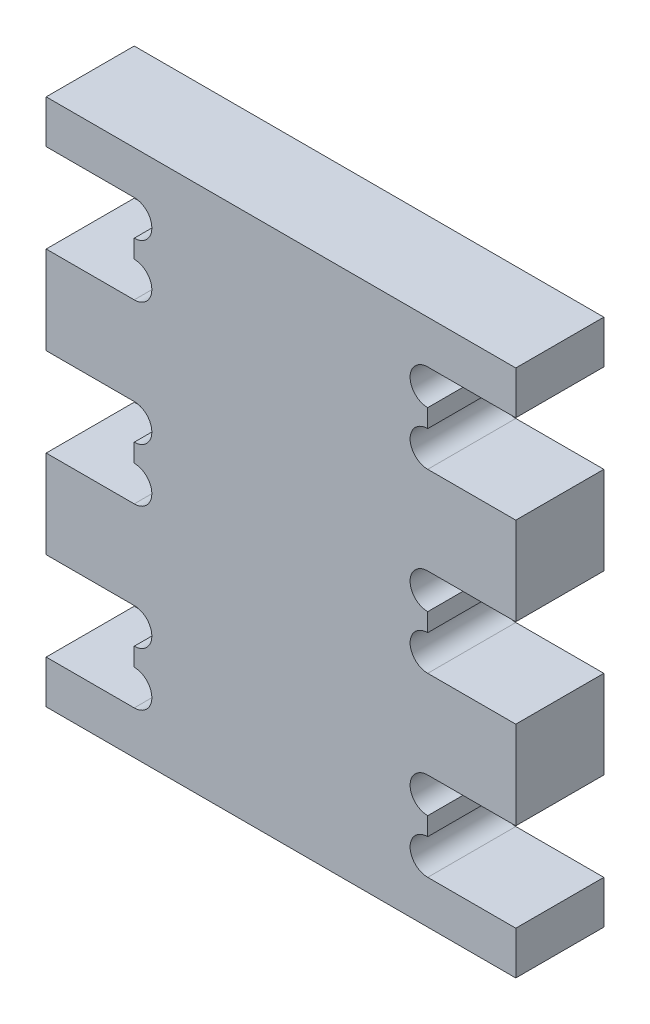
from build123d import *

# Parameters (mm, degrees)
AUFSATZ_LINEAR_AUSTRAGEN1_DEPTH = 15


with BuildPart() as part:
    # Skizze1 → Aufsatz-Linear austragen1 (new body)
    with BuildSketch(Plane.XY):
        with BuildLine():
            Line((0, 0), (50, 0))
            Line((50, 0), (65, 0))
            Line((65, 0), (65, 7.35))
            Line((65, 7.35), (50, 7.35))
            ThreePointArc((50, 7.35), (47, 10.35), (50, 13.35))
            Line((50, 13.35), (50, 16.45))
            ThreePointArc((50, 16.45), (47, 19.45), (50, 22.45))
            Line((50, 22.45), (65, 22.45))
            Line((65, 22.45), (65, 37.45))
            Line((65, 37.45), (50, 37.45))
            ThreePointArc((50, 37.45), (47, 40.45), (50, 43.45))
            Line((50, 43.45), (50, 46.55))
            ThreePointArc((50, 46.55), (47, 49.55), (50, 52.55))
            Line((50, 52.55), (65, 52.55))
            Line((65, 52.55), (65, 67.55))
            Line((65, 67.55), (50, 67.55))
            ThreePointArc((50, 67.55), (47, 70.55), (50, 73.55))
            Line((50, 73.55), (50, 76.65))
            ThreePointArc((50, 76.65), (47, 79.65), (50, 82.65))
            Line((50, 82.65), (65, 82.65))
            Line((65, 82.65), (65, 90))
            Line((65, 90), (48.733994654, 90))
            Line((48.733994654, 90), (0, 90))
            Line((0, 90), (-15, 90))
            Line((-15, 90), (-15, 82.65))
            Line((-15, 82.65), (0, 82.65))
            ThreePointArc((0, 82.65), (3, 79.65), (0, 76.65))
            Line((0, 76.65), (0, 73.55))
            ThreePointArc((0, 73.55), (3, 70.55), (0, 67.55))
            Line((0, 67.55), (-15, 67.55))
            Line((-15, 67.55), (-15, 52.55))
            Line((-15, 52.55), (0, 52.55))
            ThreePointArc((0, 52.55), (3, 49.55), (0, 46.55))
            Line((0, 46.55), (0, 43.45))
            ThreePointArc((0, 43.45), (3, 40.45), (0, 37.45))
            Line((0, 37.45), (-15, 37.45))
            Line((-15, 37.45), (-15, 22.45))
            Line((-15, 22.45), (0, 22.45))
            ThreePointArc((0, 22.45), (3, 19.45), (0, 16.45))
            Line((0, 16.45), (0, 13.35))
            ThreePointArc((0, 13.35), (3, 10.35), (0, 7.35))
            Line((0, 7.35), (-15, 7.35))
            Line((-15, 7.35), (-15, 0))
            Line((-15, 0), (0, 0))
        make_face()
    extrude(amount=AUFSATZ_LINEAR_AUSTRAGEN1_DEPTH)


solid = part.part
